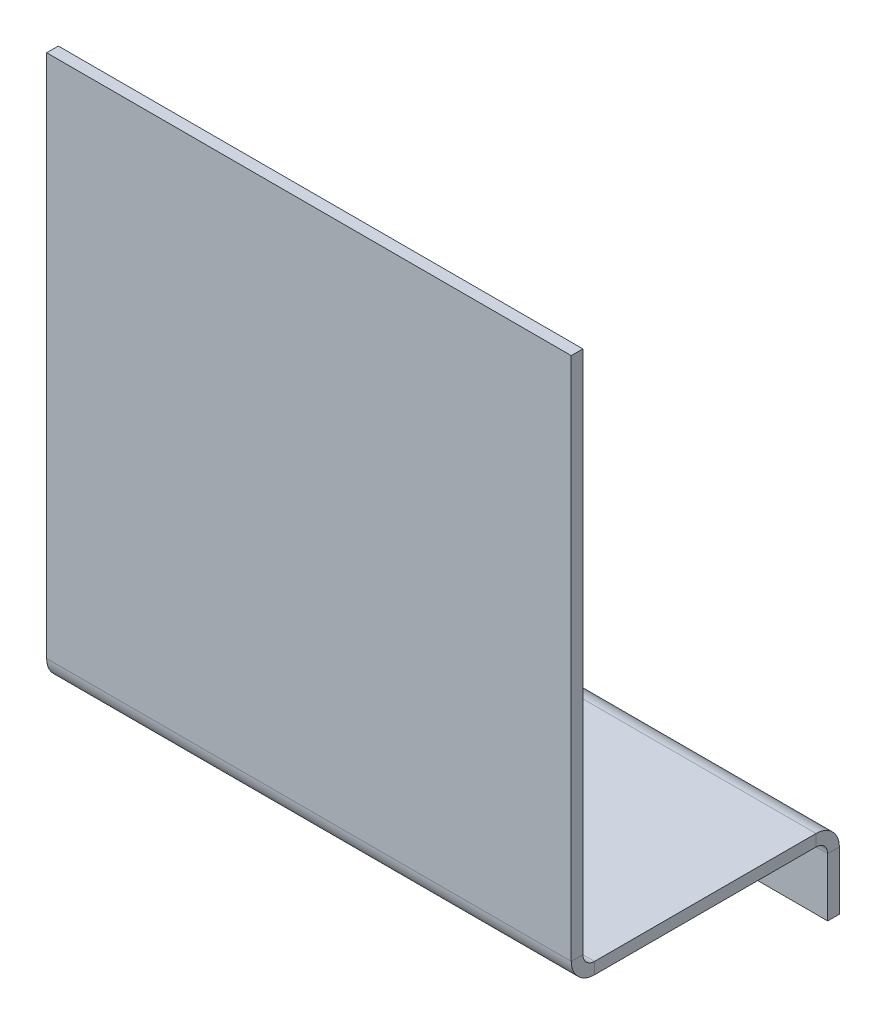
ISO-10303-21;
HEADER;
FILE_DESCRIPTION(('STEP AP214'),'2;1');
FILE_NAME('part.step','',(''),(''),'','','');
FILE_SCHEMA(('AUTOMOTIVE_DESIGN { 1 0 10303 214 1 1 1 1 }'));
ENDSEC;
DATA;
#1=APPLICATION_CONTEXT('core data for automotive mechanical design processes');
#2=APPLICATION_PROTOCOL_DEFINITION('international standard','automotive_design',2000,#1);
#3=PRODUCT_CONTEXT('',#1,'mechanical');
#4=PRODUCT('Part','Part','',(#3));
#5=PRODUCT_RELATED_PRODUCT_CATEGORY('part','',(#4));
#6=PRODUCT_DEFINITION_FORMATION('','',#4);
#7=PRODUCT_DEFINITION_CONTEXT('part definition',#1,'design');
#8=PRODUCT_DEFINITION('design','',#6,#7);
#9=PRODUCT_DEFINITION_SHAPE('','',#8);
#10=(LENGTH_UNIT() NAMED_UNIT(*) SI_UNIT(.MILLI.,.METRE.));
#11=(NAMED_UNIT(*) PLANE_ANGLE_UNIT() SI_UNIT($,.RADIAN.));
#12=(NAMED_UNIT(*) SI_UNIT($,.STERADIAN.) SOLID_ANGLE_UNIT());
#13=UNCERTAINTY_MEASURE_WITH_UNIT(LENGTH_MEASURE(1.E-05),#10,'distance_accuracy_value','');
#14=(GEOMETRIC_REPRESENTATION_CONTEXT(3) GLOBAL_UNCERTAINTY_ASSIGNED_CONTEXT((#13)) GLOBAL_UNIT_ASSIGNED_CONTEXT((#10,
#11,#12)) REPRESENTATION_CONTEXT('',''));
#15=CARTESIAN_POINT('',(0.,0.,0.));
#16=DIRECTION('',(0.,0.,1.));
#17=DIRECTION('',(1.,0.,0.));
#18=AXIS2_PLACEMENT_3D('',#15,#16,#17);
#19=CARTESIAN_POINT('',(45.,45.,0.));
#20=DIRECTION('',(0.,0.,-1.));
#21=DIRECTION('',(-1.,0.,0.));
#22=AXIS2_PLACEMENT_3D('',#19,#20,#21);
#23=PLANE('',#22);
#24=CARTESIAN_POINT('',(0.,0.,0.));
#25=DIRECTION('',(0.,0.,-1.));
#26=DIRECTION('',(-1.,0.,0.));
#27=AXIS2_PLACEMENT_3D('',#24,#25,#26);
#28=CIRCLE('',#27,15.);
#29=CARTESIAN_POINT('',(15.,0.,0.));
#30=VERTEX_POINT('',#29);
#31=CARTESIAN_POINT('',(0.,15.,0.));
#32=VERTEX_POINT('',#31);
#33=EDGE_CURVE('E365',#30,#32,#28,.F.);
#34=ORIENTED_EDGE('',*,*,#33,.T.);
#35=DIRECTION('',(0.,1.,0.));
#36=VECTOR('',#35,1.);
#37=CARTESIAN_POINT('',(0.,45.,0.));
#38=LINE('',#37,#36);
#39=CARTESIAN_POINT('',(0.,20.,0.));
#40=VERTEX_POINT('',#39);
#41=EDGE_CURVE('E13',#32,#40,#38,.T.);
#42=ORIENTED_EDGE('',*,*,#41,.T.);
#43=CARTESIAN_POINT('',(0.,0.,0.));
#44=DIRECTION('',(0.,0.,-1.));
#45=DIRECTION('',(-1.,0.,0.));
#46=AXIS2_PLACEMENT_3D('',#43,#44,#45);
#47=CIRCLE('',#46,20.);
#48=CARTESIAN_POINT('',(20.,0.,0.));
#49=VERTEX_POINT('',#48);
#50=EDGE_CURVE('E358',#49,#40,#47,.F.);
#51=ORIENTED_EDGE('',*,*,#50,.F.);
#52=DIRECTION('',(1.,0.,0.));
#53=VECTOR('',#52,1.);
#54=CARTESIAN_POINT('',(45.,0.,0.));
#55=LINE('',#54,#53);
#56=EDGE_CURVE('E377',#30,#49,#55,.T.);
#57=ORIENTED_EDGE('',*,*,#56,.F.);
#58=EDGE_LOOP('',(#34,#42,#51,#57));
#59=FACE_BOUND('',#58,.T.);
#60=ADVANCED_FACE('F76',(#59),#23,.T.);
#61=CARTESIAN_POINT('',(0.,0.,0.));
#62=DIRECTION('',(0.,0.,-1.));
#63=DIRECTION('',(-1.,0.,0.));
#64=AXIS2_PLACEMENT_3D('',#61,#62,#63);
#65=CIRCLE('',#64,10.);
#66=CARTESIAN_POINT('',(10.,0.,0.));
#67=VERTEX_POINT('',#66);
#68=CARTESIAN_POINT('',(0.,10.,0.));
#69=VERTEX_POINT('',#68);
#70=EDGE_CURVE('E372',#67,#69,#65,.F.);
#71=ORIENTED_EDGE('',*,*,#70,.T.);
#72=DIRECTION('',(0.,1.,0.));
#73=VECTOR('',#72,1.);
#74=CARTESIAN_POINT('',(0.,45.,0.));
#75=LINE('',#74,#73);
#76=EDGE_CURVE('E86',#69,#32,#75,.T.);
#77=ORIENTED_EDGE('',*,*,#76,.T.);
#78=ORIENTED_EDGE('',*,*,#33,.F.);
#79=DIRECTION('',(1.,0.,0.));
#80=VECTOR('',#79,1.);
#81=CARTESIAN_POINT('',(45.,0.,0.));
#82=LINE('',#81,#80);
#83=EDGE_CURVE('E389',#67,#30,#82,.T.);
#84=ORIENTED_EDGE('',*,*,#83,.F.);
#85=EDGE_LOOP('',(#71,#77,#78,#84));
#86=FACE_BOUND('',#85,.T.);
#87=ADVANCED_FACE('F487',(#86),#23,.T.);
#88=CARTESIAN_POINT('',(0.,0.,0.));
#89=DIRECTION('',(0.,0.,-1.));
#90=DIRECTION('',(-1.,0.,0.));
#91=AXIS2_PLACEMENT_3D('',#88,#89,#90);
#92=CIRCLE('',#91,5.);
#93=CARTESIAN_POINT('',(5.,0.,0.));
#94=VERTEX_POINT('',#93);
#95=CARTESIAN_POINT('',(0.,5.,0.));
#96=VERTEX_POINT('',#95);
#97=EDGE_CURVE('E379',#94,#96,#92,.F.);
#98=ORIENTED_EDGE('',*,*,#97,.T.);
#99=DIRECTION('',(0.,1.,0.));
#100=VECTOR('',#99,1.);
#101=CARTESIAN_POINT('',(0.,45.,0.));
#102=LINE('',#101,#100);
#103=EDGE_CURVE('E401',#96,#69,#102,.T.);
#104=ORIENTED_EDGE('',*,*,#103,.T.);
#105=ORIENTED_EDGE('',*,*,#70,.F.);
#106=DIRECTION('',(1.,0.,0.));
#107=VECTOR('',#106,1.);
#108=CARTESIAN_POINT('',(45.,0.,0.));
#109=LINE('',#108,#107);
#110=EDGE_CURVE('E388',#94,#67,#109,.T.);
#111=ORIENTED_EDGE('',*,*,#110,.F.);
#112=EDGE_LOOP('',(#98,#104,#105,#111));
#113=FACE_BOUND('',#112,.T.);
#114=ADVANCED_FACE('F491',(#113),#23,.T.);
#115=DIRECTION('',(1.,0.,0.));
#116=VECTOR('',#115,1.);
#117=CARTESIAN_POINT('',(45.,0.,0.));
#118=LINE('',#117,#116);
#119=CARTESIAN_POINT('',(0.,0.,0.));
#120=VERTEX_POINT('',#119);
#121=EDGE_CURVE('E394',#120,#94,#118,.T.);
#122=ORIENTED_EDGE('',*,*,#121,.F.);
#123=DIRECTION('',(0.,1.,0.));
#124=VECTOR('',#123,1.);
#125=CARTESIAN_POINT('',(0.,45.,0.));
#126=LINE('',#125,#124);
#127=EDGE_CURVE('E405',#120,#96,#126,.T.);
#128=ORIENTED_EDGE('',*,*,#127,.T.);
#129=ORIENTED_EDGE('',*,*,#97,.F.);
#130=EDGE_LOOP('',(#122,#128,#129));
#131=FACE_BOUND('',#130,.T.);
#132=ADVANCED_FACE('F547',(#131),#23,.T.);
#133=CARTESIAN_POINT('',(0.,-5.,0.));
#134=VERTEX_POINT('',#133);
#135=EDGE_CURVE('E378',#134,#94,#92,.F.);
#136=ORIENTED_EDGE('',*,*,#135,.F.);
#137=DIRECTION('',(0.,1.,0.));
#138=VECTOR('',#137,1.);
#139=CARTESIAN_POINT('',(0.,45.,0.));
#140=LINE('',#139,#138);
#141=EDGE_CURVE('E409',#134,#120,#140,.T.);
#142=ORIENTED_EDGE('',*,*,#141,.T.);
#143=ORIENTED_EDGE('',*,*,#121,.T.);
#144=EDGE_LOOP('',(#136,#142,#143));
#145=FACE_BOUND('',#144,.T.);
#146=ADVANCED_FACE('F458',(#145),#23,.T.);
#147=CARTESIAN_POINT('',(0.,-10.,0.));
#148=VERTEX_POINT('',#147);
#149=EDGE_CURVE('E371',#148,#67,#65,.F.);
#150=ORIENTED_EDGE('',*,*,#149,.F.);
#151=DIRECTION('',(0.,1.,0.));
#152=VECTOR('',#151,1.);
#153=CARTESIAN_POINT('',(0.,45.,0.));
#154=LINE('',#153,#152);
#155=EDGE_CURVE('E413',#148,#134,#154,.T.);
#156=ORIENTED_EDGE('',*,*,#155,.T.);
#157=ORIENTED_EDGE('',*,*,#135,.T.);
#158=ORIENTED_EDGE('',*,*,#110,.T.);
#159=EDGE_LOOP('',(#150,#156,#157,#158));
#160=FACE_BOUND('',#159,.T.);
#161=ADVANCED_FACE('F454',(#160),#23,.T.);
#162=CARTESIAN_POINT('',(0.,-15.,0.));
#163=VERTEX_POINT('',#162);
#164=EDGE_CURVE('E364',#163,#30,#28,.F.);
#165=ORIENTED_EDGE('',*,*,#164,.F.);
#166=DIRECTION('',(0.,1.,0.));
#167=VECTOR('',#166,1.);
#168=CARTESIAN_POINT('',(0.,45.,0.));
#169=LINE('',#168,#167);
#170=EDGE_CURVE('E416',#163,#148,#169,.T.);
#171=ORIENTED_EDGE('',*,*,#170,.T.);
#172=ORIENTED_EDGE('',*,*,#149,.T.);
#173=ORIENTED_EDGE('',*,*,#83,.T.);
#174=EDGE_LOOP('',(#165,#171,#172,#173));
#175=FACE_BOUND('',#174,.T.);
#176=ADVANCED_FACE('F435',(#175),#23,.T.);
#177=CARTESIAN_POINT('',(0.,-20.,0.));
#178=VERTEX_POINT('',#177);
#179=EDGE_CURVE('E357',#178,#49,#47,.F.);
#180=ORIENTED_EDGE('',*,*,#179,.F.);
#181=DIRECTION('',(0.,1.,0.));
#182=VECTOR('',#181,1.);
#183=CARTESIAN_POINT('',(0.,45.,0.));
#184=LINE('',#183,#182);
#185=EDGE_CURVE('E80',#178,#163,#184,.T.);
#186=ORIENTED_EDGE('',*,*,#185,.T.);
#187=ORIENTED_EDGE('',*,*,#164,.T.);
#188=ORIENTED_EDGE('',*,*,#56,.T.);
#189=EDGE_LOOP('',(#180,#186,#187,#188));
#190=FACE_BOUND('',#189,.T.);
#191=ADVANCED_FACE('F431',(#190),#23,.T.);
#192=ORIENTED_EDGE('',*,*,#141,.F.);
#193=CARTESIAN_POINT('',(-5.,0.,0.));
#194=VERTEX_POINT('',#193);
#195=EDGE_CURVE('E373',#194,#134,#92,.F.);
#196=ORIENTED_EDGE('',*,*,#195,.F.);
#197=EDGE_CURVE('E395',#194,#120,#118,.T.);
#198=ORIENTED_EDGE('',*,*,#197,.T.);
#199=EDGE_LOOP('',(#192,#196,#198));
#200=FACE_BOUND('',#199,.T.);
#201=ADVANCED_FACE('F479',(#200),#23,.T.);
#202=ORIENTED_EDGE('',*,*,#155,.F.);
#203=CARTESIAN_POINT('',(-10.,0.,0.));
#204=VERTEX_POINT('',#203);
#205=EDGE_CURVE('E366',#204,#148,#65,.F.);
#206=ORIENTED_EDGE('',*,*,#205,.F.);
#207=EDGE_CURVE('E390',#204,#194,#109,.T.);
#208=ORIENTED_EDGE('',*,*,#207,.T.);
#209=ORIENTED_EDGE('',*,*,#195,.T.);
#210=EDGE_LOOP('',(#202,#206,#208,#209));
#211=FACE_BOUND('',#210,.T.);
#212=ADVANCED_FACE('F448',(#211),#23,.T.);
#213=ORIENTED_EDGE('',*,*,#170,.F.);
#214=CARTESIAN_POINT('',(-15.,0.,0.));
#215=VERTEX_POINT('',#214);
#216=EDGE_CURVE('E359',#215,#163,#28,.F.);
#217=ORIENTED_EDGE('',*,*,#216,.F.);
#218=EDGE_CURVE('E384',#215,#204,#82,.T.);
#219=ORIENTED_EDGE('',*,*,#218,.T.);
#220=ORIENTED_EDGE('',*,*,#205,.T.);
#221=EDGE_LOOP('',(#213,#217,#219,#220));
#222=FACE_BOUND('',#221,.T.);
#223=ADVANCED_FACE('F444',(#222),#23,.T.);
#224=ORIENTED_EDGE('',*,*,#185,.F.);
#225=CARTESIAN_POINT('',(-20.,0.,0.));
#226=VERTEX_POINT('',#225);
#227=EDGE_CURVE('E352',#226,#178,#47,.F.);
#228=ORIENTED_EDGE('',*,*,#227,.F.);
#229=EDGE_CURVE('E383',#226,#215,#55,.T.);
#230=ORIENTED_EDGE('',*,*,#229,.T.);
#231=ORIENTED_EDGE('',*,*,#216,.T.);
#232=EDGE_LOOP('',(#224,#228,#230,#231));
#233=FACE_BOUND('',#232,.T.);
#234=ADVANCED_FACE('F441',(#233),#23,.T.);
#235=ORIENTED_EDGE('',*,*,#103,.F.);
#236=EDGE_CURVE('E370',#96,#194,#92,.F.);
#237=ORIENTED_EDGE('',*,*,#236,.T.);
#238=ORIENTED_EDGE('',*,*,#207,.F.);
#239=EDGE_CURVE('E363',#69,#204,#65,.F.);
#240=ORIENTED_EDGE('',*,*,#239,.F.);
#241=EDGE_LOOP('',(#235,#237,#238,#240));
#242=FACE_BOUND('',#241,.T.);
#243=ADVANCED_FACE('F474',(#242),#23,.T.);
#244=ORIENTED_EDGE('',*,*,#76,.F.);
#245=ORIENTED_EDGE('',*,*,#239,.T.);
#246=ORIENTED_EDGE('',*,*,#218,.F.);
#247=EDGE_CURVE('E356',#32,#215,#28,.F.);
#248=ORIENTED_EDGE('',*,*,#247,.F.);
#249=EDGE_LOOP('',(#244,#245,#246,#248));
#250=FACE_BOUND('',#249,.T.);
#251=ADVANCED_FACE('F509',(#250),#23,.T.);
#252=ORIENTED_EDGE('',*,*,#41,.F.);
#253=ORIENTED_EDGE('',*,*,#247,.T.);
#254=ORIENTED_EDGE('',*,*,#229,.F.);
#255=EDGE_CURVE('E351',#40,#226,#47,.F.);
#256=ORIENTED_EDGE('',*,*,#255,.F.);
#257=EDGE_LOOP('',(#252,#253,#254,#256));
#258=FACE_BOUND('',#257,.T.);
#259=ADVANCED_FACE('F504',(#258),#23,.T.);
#260=DIRECTION('',(0.,-1.,0.));
#261=VECTOR('',#260,1.);
#262=CARTESIAN_POINT('',(-45.,45.,0.));
#263=LINE('',#262,#261);
#264=CARTESIAN_POINT('',(-45.,45.,0.));
#265=VERTEX_POINT('',#264);
#266=CARTESIAN_POINT('',(-45.,-45.,0.));
#267=VERTEX_POINT('',#266);
#268=EDGE_CURVE('E325',#265,#267,#263,.T.);
#269=ORIENTED_EDGE('',*,*,#268,.F.);
#270=DIRECTION('',(-1.,0.,0.));
#271=VECTOR('',#270,1.);
#272=CARTESIAN_POINT('',(45.,45.,0.));
#273=LINE('',#272,#271);
#274=CARTESIAN_POINT('',(45.,45.,0.));
#275=VERTEX_POINT('',#274);
#276=EDGE_CURVE('E344',#275,#265,#273,.T.);
#277=ORIENTED_EDGE('',*,*,#276,.F.);
#278=DIRECTION('',(0.,-1.,0.));
#279=VECTOR('',#278,1.);
#280=CARTESIAN_POINT('',(45.,45.,0.));
#281=LINE('',#280,#279);
#282=CARTESIAN_POINT('',(45.,-45.,0.));
#283=VERTEX_POINT('',#282);
#284=EDGE_CURVE('E336',#275,#283,#281,.T.);
#285=ORIENTED_EDGE('',*,*,#284,.T.);
#286=DIRECTION('',(-1.,0.,0.));
#287=VECTOR('',#286,1.);
#288=CARTESIAN_POINT('',(45.,-45.,0.));
#289=LINE('',#288,#287);
#290=EDGE_CURVE('E346',#283,#267,#289,.T.);
#291=ORIENTED_EDGE('',*,*,#290,.T.);
#292=EDGE_LOOP('',(#269,#277,#285,#291));
#293=FACE_BOUND('',#292,.T.);
#294=ORIENTED_EDGE('',*,*,#227,.T.);
#295=ORIENTED_EDGE('',*,*,#179,.T.);
#296=ORIENTED_EDGE('',*,*,#50,.T.);
#297=ORIENTED_EDGE('',*,*,#255,.T.);
#298=EDGE_LOOP('',(#294,#295,#296,#297));
#299=FACE_BOUND('',#298,.T.);
#300=ADVANCED_FACE('F495',(#293,#299),#23,.T.);
#301=CARTESIAN_POINT('',(45.,45.,1.99999999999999));
#302=DIRECTION('',(0.,0.,-1.));
#303=DIRECTION('',(-1.,0.,0.));
#304=AXIS2_PLACEMENT_3D('',#301,#302,#303);
#305=PLANE('',#304);
#306=DIRECTION('',(0.,1.,0.));
#307=VECTOR('',#306,1.);
#308=CARTESIAN_POINT('',(-45.,45.,1.99999999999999));
#309=LINE('',#308,#307);
#310=CARTESIAN_POINT('',(-45.,45.,1.99999999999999));
#311=VERTEX_POINT('',#310);
#312=CARTESIAN_POINT('',(-45.,-45.,1.99999999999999));
#313=VERTEX_POINT('',#312);
#314=EDGE_CURVE('E318',#311,#313,#309,.F.);
#315=ORIENTED_EDGE('',*,*,#314,.T.);
#316=DIRECTION('',(-1.,0.,0.));
#317=VECTOR('',#316,1.);
#318=CARTESIAN_POINT('',(45.,-45.,1.99999999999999));
#319=LINE('',#318,#317);
#320=CARTESIAN_POINT('',(45.,-45.,1.99999999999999));
#321=VERTEX_POINT('',#320);
#322=EDGE_CURVE('E348',#321,#313,#319,.T.);
#323=ORIENTED_EDGE('',*,*,#322,.F.);
#324=DIRECTION('',(0.,1.,0.));
#325=VECTOR('',#324,1.);
#326=CARTESIAN_POINT('',(45.,45.,1.99999999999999));
#327=LINE('',#326,#325);
#328=CARTESIAN_POINT('',(45.,45.,1.99999999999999));
#329=VERTEX_POINT('',#328);
#330=EDGE_CURVE('E331',#329,#321,#327,.F.);
#331=ORIENTED_EDGE('',*,*,#330,.F.);
#332=DIRECTION('',(-1.,0.,0.));
#333=VECTOR('',#332,1.);
#334=CARTESIAN_POINT('',(45.,45.,1.99999999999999));
#335=LINE('',#334,#333);
#336=EDGE_CURVE('E342',#329,#311,#335,.T.);
#337=ORIENTED_EDGE('',*,*,#336,.T.);
#338=EDGE_LOOP('',(#315,#323,#331,#337));
#339=FACE_BOUND('',#338,.T.);
#340=ADVANCED_FACE('F78',(#339),#305,.F.);
#341=ORIENTED_EDGE('',*,*,#127,.F.);
#342=ORIENTED_EDGE('',*,*,#197,.F.);
#343=ORIENTED_EDGE('',*,*,#236,.F.);
#344=EDGE_LOOP('',(#341,#342,#343));
#345=FACE_BOUND('',#344,.T.);
#346=ADVANCED_FACE('F477',(#345),#23,.T.);
#347=CARTESIAN_POINT('',(45.,45.,1.99999999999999));
#348=DIRECTION('',(0.,1.,0.));
#349=DIRECTION('',(0.,0.,1.));
#350=AXIS2_PLACEMENT_3D('',#347,#348,#349);
#351=PLANE('',#350);
#352=DIRECTION('',(0.,0.,-1.));
#353=VECTOR('',#352,1.);
#354=CARTESIAN_POINT('',(-45.,45.,1.99999999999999));
#355=LINE('',#354,#353);
#356=EDGE_CURVE('E328',#311,#265,#355,.T.);
#357=ORIENTED_EDGE('',*,*,#356,.F.);
#358=ORIENTED_EDGE('',*,*,#336,.F.);
#359=DIRECTION('',(0.,0.,-1.));
#360=VECTOR('',#359,1.);
#361=CARTESIAN_POINT('',(45.,45.,1.99999999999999));
#362=LINE('',#361,#360);
#363=EDGE_CURVE('E339',#329,#275,#362,.T.);
#364=ORIENTED_EDGE('',*,*,#363,.T.);
#365=ORIENTED_EDGE('',*,*,#276,.T.);
#366=EDGE_LOOP('',(#357,#358,#364,#365));
#367=FACE_BOUND('',#366,.T.);
#368=ADVANCED_FACE('F494',(#367),#351,.T.);
#369=CARTESIAN_POINT('',(45.,-45.,1.99999999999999));
#370=DIRECTION('',(1.,0.,0.));
#371=DIRECTION('',(0.,0.,-1.));
#372=AXIS2_PLACEMENT_3D('',#369,#370,#371);
#373=PLANE('',#372);
#374=ORIENTED_EDGE('',*,*,#330,.T.);
#375=DIRECTION('',(0.,0.,1.));
#376=VECTOR('',#375,1.);
#377=CARTESIAN_POINT('',(45.,-45.,0.));
#378=LINE('',#377,#376);
#379=EDGE_CURVE('E333',#283,#321,#378,.T.);
#380=ORIENTED_EDGE('',*,*,#379,.F.);
#381=ORIENTED_EDGE('',*,*,#284,.F.);
#382=ORIENTED_EDGE('',*,*,#363,.F.);
#383=EDGE_LOOP('',(#374,#380,#381,#382));
#384=FACE_BOUND('',#383,.T.);
#385=ADVANCED_FACE('F500',(#384),#373,.T.);
#386=CARTESIAN_POINT('',(-45.,-45.,1.99999999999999));
#387=DIRECTION('',(1.,0.,0.));
#388=DIRECTION('',(0.,0.,-1.));
#389=AXIS2_PLACEMENT_3D('',#386,#387,#388);
#390=PLANE('',#389);
#391=ORIENTED_EDGE('',*,*,#314,.F.);
#392=ORIENTED_EDGE('',*,*,#356,.T.);
#393=ORIENTED_EDGE('',*,*,#268,.T.);
#394=DIRECTION('',(0.,0.,1.));
#395=VECTOR('',#394,1.);
#396=CARTESIAN_POINT('',(-45.,-45.,0.));
#397=LINE('',#396,#395);
#398=EDGE_CURVE('E323',#267,#313,#397,.T.);
#399=ORIENTED_EDGE('',*,*,#398,.T.);
#400=EDGE_LOOP('',(#391,#392,#393,#399));
#401=FACE_BOUND('',#400,.T.);
#402=ADVANCED_FACE('F770',(#401),#390,.F.);
#403=CARTESIAN_POINT('',(45.,-45.,-2.00000000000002));
#404=DIRECTION('',(1.,0.,0.));
#405=DIRECTION('',(0.,0.,-1.));
#406=AXIS2_PLACEMENT_3D('',#403,#404,#405);
#407=PLANE('',#406);
#408=DIRECTION('',(0.,1.,0.));
#409=VECTOR('',#408,1.);
#410=CARTESIAN_POINT('',(45.,-49.,-2.));
#411=LINE('',#410,#409);
#412=CARTESIAN_POINT('',(45.,-47.,-2.00000000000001));
#413=VERTEX_POINT('',#412);
#414=CARTESIAN_POINT('',(45.,-49.,-2.));
#415=VERTEX_POINT('',#414);
#416=EDGE_CURVE('E277',#413,#415,#411,.F.);
#417=ORIENTED_EDGE('',*,*,#416,.F.);
#418=CARTESIAN_POINT('',(45.,-45.,-2.00000000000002));
#419=DIRECTION('',(-1.,0.,0.));
#420=DIRECTION('',(0.,0.,1.));
#421=AXIS2_PLACEMENT_3D('',#418,#419,#420);
#422=CIRCLE('',#421,2.);
#423=EDGE_CURVE('E309',#283,#413,#422,.F.);
#424=ORIENTED_EDGE('',*,*,#423,.F.);
#425=ORIENTED_EDGE('',*,*,#379,.T.);
#426=CARTESIAN_POINT('',(45.,-45.,-2.00000000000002));
#427=DIRECTION('',(-1.,0.,0.));
#428=DIRECTION('',(0.,0.,1.));
#429=AXIS2_PLACEMENT_3D('',#426,#427,#428);
#430=CIRCLE('',#429,4.);
#431=EDGE_CURVE('E315',#321,#415,#430,.F.);
#432=ORIENTED_EDGE('',*,*,#431,.T.);
#433=EDGE_LOOP('',(#417,#424,#425,#432));
#434=FACE_BOUND('',#433,.T.);
#435=ADVANCED_FACE('F751',(#434),#407,.T.);
#436=CARTESIAN_POINT('',(-45.,-45.,-2.00000000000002));
#437=DIRECTION('',(1.,0.,0.));
#438=DIRECTION('',(0.,0.,-1.));
#439=AXIS2_PLACEMENT_3D('',#436,#437,#438);
#440=PLANE('',#439);
#441=CARTESIAN_POINT('',(-45.,-45.,-2.00000000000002));
#442=DIRECTION('',(-1.,0.,0.));
#443=DIRECTION('',(0.,0.,1.));
#444=AXIS2_PLACEMENT_3D('',#441,#442,#443);
#445=CIRCLE('',#444,2.);
#446=CARTESIAN_POINT('',(-45.,-47.,-2.00000000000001));
#447=VERTEX_POINT('',#446);
#448=EDGE_CURVE('E281',#447,#267,#445,.T.);
#449=ORIENTED_EDGE('',*,*,#448,.F.);
#450=DIRECTION('',(0.,1.,0.));
#451=VECTOR('',#450,1.);
#452=CARTESIAN_POINT('',(-45.,-47.,-2.00000000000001));
#453=LINE('',#452,#451);
#454=CARTESIAN_POINT('',(-45.,-49.,-2.));
#455=VERTEX_POINT('',#454);
#456=EDGE_CURVE('E302',#447,#455,#453,.F.);
#457=ORIENTED_EDGE('',*,*,#456,.T.);
#458=CARTESIAN_POINT('',(-45.,-45.,-2.00000000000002));
#459=DIRECTION('',(-1.,0.,0.));
#460=DIRECTION('',(0.,0.,1.));
#461=AXIS2_PLACEMENT_3D('',#458,#459,#460);
#462=CIRCLE('',#461,4.);
#463=EDGE_CURVE('E312',#455,#313,#462,.T.);
#464=ORIENTED_EDGE('',*,*,#463,.T.);
#465=ORIENTED_EDGE('',*,*,#398,.F.);
#466=EDGE_LOOP('',(#449,#457,#464,#465));
#467=FACE_BOUND('',#466,.T.);
#468=ADVANCED_FACE('F740',(#467),#440,.F.);
#469=CARTESIAN_POINT('',(-45.,-45.,-2.00000000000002));
#470=DIRECTION('',(-1.,0.,0.));
#471=DIRECTION('',(0.,-1.,0.));
#472=AXIS2_PLACEMENT_3D('',#469,#470,#471);
#473=CYLINDRICAL_SURFACE('',#472,4.);
#474=ORIENTED_EDGE('',*,*,#322,.T.);
#475=ORIENTED_EDGE('',*,*,#463,.F.);
#476=DIRECTION('',(-1.,0.,0.));
#477=VECTOR('',#476,1.);
#478=CARTESIAN_POINT('',(45.,-49.,-2.));
#479=LINE('',#478,#477);
#480=EDGE_CURVE('E300',#455,#415,#479,.F.);
#481=ORIENTED_EDGE('',*,*,#480,.T.);
#482=ORIENTED_EDGE('',*,*,#431,.F.);
#483=EDGE_LOOP('',(#474,#475,#481,#482));
#484=FACE_BOUND('',#483,.T.);
#485=ADVANCED_FACE('F737',(#484),#473,.T.);
#486=CARTESIAN_POINT('',(-45.,-45.,-2.00000000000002));
#487=DIRECTION('',(-1.,0.,0.));
#488=DIRECTION('',(0.,-1.,0.));
#489=AXIS2_PLACEMENT_3D('',#486,#487,#488);
#490=CYLINDRICAL_SURFACE('',#489,2.);
#491=ORIENTED_EDGE('',*,*,#290,.F.);
#492=ORIENTED_EDGE('',*,*,#423,.T.);
#493=DIRECTION('',(-1.,0.,0.));
#494=VECTOR('',#493,1.);
#495=CARTESIAN_POINT('',(45.,-47.,-2.00000000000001));
#496=LINE('',#495,#494);
#497=EDGE_CURVE('E305',#413,#447,#496,.T.);
#498=ORIENTED_EDGE('',*,*,#497,.T.);
#499=ORIENTED_EDGE('',*,*,#448,.T.);
#500=EDGE_LOOP('',(#491,#492,#498,#499));
#501=FACE_BOUND('',#500,.T.);
#502=ADVANCED_FACE('F719',(#501),#490,.F.);
#503=CARTESIAN_POINT('',(45.,-49.,0.));
#504=DIRECTION('',(-1.,0.,0.));
#505=DIRECTION('',(0.,0.,1.));
#506=AXIS2_PLACEMENT_3D('',#503,#504,#505);
#507=PLANE('',#506);
#508=ORIENTED_EDGE('',*,*,#416,.T.);
#509=DIRECTION('',(0.,0.,1.));
#510=VECTOR('',#509,1.);
#511=CARTESIAN_POINT('',(45.,-49.0000000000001,-40.));
#512=LINE('',#511,#510);
#513=CARTESIAN_POINT('',(45.,-49.0000000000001,-40.));
#514=VERTEX_POINT('',#513);
#515=EDGE_CURVE('E289',#514,#415,#512,.T.);
#516=ORIENTED_EDGE('',*,*,#515,.F.);
#517=DIRECTION('',(0.,1.,0.));
#518=VECTOR('',#517,1.);
#519=CARTESIAN_POINT('',(45.,-49.0000000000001,-40.));
#520=LINE('',#519,#518);
#521=CARTESIAN_POINT('',(45.,-47.0000000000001,-40.));
#522=VERTEX_POINT('',#521);
#523=EDGE_CURVE('E282',#514,#522,#520,.T.);
#524=ORIENTED_EDGE('',*,*,#523,.T.);
#525=DIRECTION('',(0.,0.,-1.));
#526=VECTOR('',#525,1.);
#527=CARTESIAN_POINT('',(45.,-47.,0.));
#528=LINE('',#527,#526);
#529=EDGE_CURVE('E297',#522,#413,#528,.F.);
#530=ORIENTED_EDGE('',*,*,#529,.T.);
#531=EDGE_LOOP('',(#508,#516,#524,#530));
#532=FACE_BOUND('',#531,.T.);
#533=ADVANCED_FACE('F708',(#532),#507,.F.);
#534=CARTESIAN_POINT('',(-45.,-49.0000000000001,-40.));
#535=DIRECTION('',(1.,0.,0.));
#536=DIRECTION('',(0.,0.,-1.));
#537=AXIS2_PLACEMENT_3D('',#534,#535,#536);
#538=PLANE('',#537);
#539=ORIENTED_EDGE('',*,*,#456,.F.);
#540=DIRECTION('',(0.,0.,1.));
#541=VECTOR('',#540,1.);
#542=CARTESIAN_POINT('',(-45.,-47.0000000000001,-40.));
#543=LINE('',#542,#541);
#544=CARTESIAN_POINT('',(-45.,-47.0000000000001,-40.));
#545=VERTEX_POINT('',#544);
#546=EDGE_CURVE('E295',#447,#545,#543,.F.);
#547=ORIENTED_EDGE('',*,*,#546,.T.);
#548=DIRECTION('',(0.,1.,0.));
#549=VECTOR('',#548,1.);
#550=CARTESIAN_POINT('',(-45.,-49.0000000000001,-40.));
#551=LINE('',#550,#549);
#552=CARTESIAN_POINT('',(-45.,-49.0000000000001,-40.));
#553=VERTEX_POINT('',#552);
#554=EDGE_CURVE('E278',#553,#545,#551,.T.);
#555=ORIENTED_EDGE('',*,*,#554,.F.);
#556=DIRECTION('',(0.,0.,-1.));
#557=VECTOR('',#556,1.);
#558=CARTESIAN_POINT('',(-45.,-49.0000000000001,-40.));
#559=LINE('',#558,#557);
#560=EDGE_CURVE('E287',#455,#553,#559,.T.);
#561=ORIENTED_EDGE('',*,*,#560,.F.);
#562=EDGE_LOOP('',(#539,#547,#555,#561));
#563=FACE_BOUND('',#562,.T.);
#564=ADVANCED_FACE('F697',(#563),#538,.F.);
#565=CARTESIAN_POINT('',(45.,-49.0000000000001,-40.));
#566=DIRECTION('',(0.,1.,0.));
#567=DIRECTION('',(0.,0.,1.));
#568=AXIS2_PLACEMENT_3D('',#565,#566,#567);
#569=PLANE('',#568);
#570=CARTESIAN_POINT('',(0.,-49.,-12.));
#571=DIRECTION('',(0.,1.,0.));
#572=DIRECTION('',(0.,0.,1.));
#573=AXIS2_PLACEMENT_3D('',#570,#571,#572);
#574=CIRCLE('',#573,3.19999999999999);
#575=CARTESIAN_POINT('',(0.,-49.,-8.80000000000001));
#576=VERTEX_POINT('',#575);
#577=EDGE_CURVE('E274',#576,#576,#574,.T.);
#578=ORIENTED_EDGE('',*,*,#577,.T.);
#579=EDGE_LOOP('',(#578));
#580=FACE_BOUND('',#579,.T.);
#581=ORIENTED_EDGE('',*,*,#480,.F.);
#582=ORIENTED_EDGE('',*,*,#560,.T.);
#583=DIRECTION('',(1.,0.,0.));
#584=VECTOR('',#583,1.);
#585=CARTESIAN_POINT('',(45.,-49.0000000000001,-40.));
#586=LINE('',#585,#584);
#587=EDGE_CURVE('E285',#553,#514,#586,.T.);
#588=ORIENTED_EDGE('',*,*,#587,.T.);
#589=ORIENTED_EDGE('',*,*,#515,.T.);
#590=EDGE_LOOP('',(#581,#582,#588,#589));
#591=FACE_BOUND('',#590,.T.);
#592=ADVANCED_FACE('F686',(#580,#591),#569,.F.);
#593=CARTESIAN_POINT('',(45.,-47.0000000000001,-40.));
#594=DIRECTION('',(0.,1.,0.));
#595=DIRECTION('',(0.,0.,1.));
#596=AXIS2_PLACEMENT_3D('',#593,#594,#595);
#597=PLANE('',#596);
#598=CARTESIAN_POINT('',(0.,-47.,-12.));
#599=DIRECTION('',(0.,1.,0.));
#600=DIRECTION('',(0.,0.,1.));
#601=AXIS2_PLACEMENT_3D('',#598,#599,#600);
#602=CIRCLE('',#601,3.19999999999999);
#603=CARTESIAN_POINT('',(0.,-47.,-8.80000000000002));
#604=VERTEX_POINT('',#603);
#605=EDGE_CURVE('E269',#604,#604,#602,.T.);
#606=ORIENTED_EDGE('',*,*,#605,.F.);
#607=EDGE_LOOP('',(#606));
#608=FACE_BOUND('',#607,.T.);
#609=ORIENTED_EDGE('',*,*,#546,.F.);
#610=ORIENTED_EDGE('',*,*,#497,.F.);
#611=ORIENTED_EDGE('',*,*,#529,.F.);
#612=DIRECTION('',(-1.,0.,0.));
#613=VECTOR('',#612,1.);
#614=CARTESIAN_POINT('',(45.,-47.0000000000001,-40.));
#615=LINE('',#614,#613);
#616=EDGE_CURVE('E292',#545,#522,#615,.F.);
#617=ORIENTED_EDGE('',*,*,#616,.F.);
#618=EDGE_LOOP('',(#609,#610,#611,#617));
#619=FACE_BOUND('',#618,.T.);
#620=ADVANCED_FACE('F681',(#608,#619),#597,.T.);
#621=CARTESIAN_POINT('',(0.,-47.,-12.));
#622=DIRECTION('',(0.,1.,0.));
#623=DIRECTION('',(0.,0.,1.));
#624=AXIS2_PLACEMENT_3D('',#621,#622,#623);
#625=CYLINDRICAL_SURFACE('',#624,3.19999999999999);
#626=ORIENTED_EDGE('',*,*,#577,.F.);
#627=EDGE_LOOP('',(#626));
#628=FACE_BOUND('',#627,.T.);
#629=ORIENTED_EDGE('',*,*,#605,.T.);
#630=EDGE_LOOP('',(#629));
#631=FACE_BOUND('',#630,.T.);
#632=ADVANCED_FACE('F672',(#628,#631),#625,.F.);
#633=CARTESIAN_POINT('',(-45.,-51.0000000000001,-40.));
#634=DIRECTION('',(-1.,0.,0.));
#635=DIRECTION('',(0.,0.,1.));
#636=AXIS2_PLACEMENT_3D('',#633,#634,#635);
#637=PLANE('',#636);
#638=DIRECTION('',(0.,0.,1.));
#639=VECTOR('',#638,1.);
#640=CARTESIAN_POINT('',(-45.,-51.0000000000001,-44.));
#641=LINE('',#640,#639);
#642=CARTESIAN_POINT('',(-45.,-51.0000000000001,-42.));
#643=VERTEX_POINT('',#642);
#644=CARTESIAN_POINT('',(-45.,-51.0000000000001,-44.));
#645=VERTEX_POINT('',#644);
#646=EDGE_CURVE('E240',#643,#645,#641,.F.);
#647=ORIENTED_EDGE('',*,*,#646,.F.);
#648=CARTESIAN_POINT('',(-45.,-51.0000000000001,-40.));
#649=DIRECTION('',(1.,0.,0.));
#650=DIRECTION('',(0.,0.,-1.));
#651=AXIS2_PLACEMENT_3D('',#648,#649,#650);
#652=CIRCLE('',#651,2.);
#653=EDGE_CURVE('E259',#553,#643,#652,.F.);
#654=ORIENTED_EDGE('',*,*,#653,.F.);
#655=ORIENTED_EDGE('',*,*,#554,.T.);
#656=CARTESIAN_POINT('',(-45.,-51.0000000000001,-40.));
#657=DIRECTION('',(1.,0.,0.));
#658=DIRECTION('',(0.,0.,-1.));
#659=AXIS2_PLACEMENT_3D('',#656,#657,#658);
#660=CIRCLE('',#659,4.);
#661=EDGE_CURVE('E266',#545,#645,#660,.F.);
#662=ORIENTED_EDGE('',*,*,#661,.T.);
#663=EDGE_LOOP('',(#647,#654,#655,#662));
#664=FACE_BOUND('',#663,.T.);
#665=ADVANCED_FACE('F653',(#664),#637,.T.);
#666=CARTESIAN_POINT('',(45.,-51.0000000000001,-40.));
#667=DIRECTION('',(-1.,0.,0.));
#668=DIRECTION('',(0.,0.,1.));
#669=AXIS2_PLACEMENT_3D('',#666,#667,#668);
#670=PLANE('',#669);
#671=CARTESIAN_POINT('',(45.,-51.0000000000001,-40.));
#672=DIRECTION('',(1.,0.,0.));
#673=DIRECTION('',(0.,0.,-1.));
#674=AXIS2_PLACEMENT_3D('',#671,#672,#673);
#675=CIRCLE('',#674,2.);
#676=CARTESIAN_POINT('',(45.,-51.0000000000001,-42.));
#677=VERTEX_POINT('',#676);
#678=EDGE_CURVE('E263',#677,#514,#675,.T.);
#679=ORIENTED_EDGE('',*,*,#678,.F.);
#680=DIRECTION('',(0.,0.,1.));
#681=VECTOR('',#680,1.);
#682=CARTESIAN_POINT('',(45.,-51.0000000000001,-42.));
#683=LINE('',#682,#681);
#684=CARTESIAN_POINT('',(45.,-51.0000000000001,-44.));
#685=VERTEX_POINT('',#684);
#686=EDGE_CURVE('E252',#677,#685,#683,.F.);
#687=ORIENTED_EDGE('',*,*,#686,.T.);
#688=CARTESIAN_POINT('',(45.,-51.0000000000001,-40.));
#689=DIRECTION('',(1.,0.,0.));
#690=DIRECTION('',(0.,0.,-1.));
#691=AXIS2_PLACEMENT_3D('',#688,#689,#690);
#692=CIRCLE('',#691,4.);
#693=EDGE_CURVE('E262',#685,#522,#692,.T.);
#694=ORIENTED_EDGE('',*,*,#693,.T.);
#695=ORIENTED_EDGE('',*,*,#523,.F.);
#696=EDGE_LOOP('',(#679,#687,#694,#695));
#697=FACE_BOUND('',#696,.T.);
#698=ADVANCED_FACE('F642',(#697),#670,.F.);
#699=CARTESIAN_POINT('',(45.,-51.0000000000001,-40.));
#700=DIRECTION('',(1.,0.,0.));
#701=DIRECTION('',(0.,0.,-1.));
#702=AXIS2_PLACEMENT_3D('',#699,#700,#701);
#703=CYLINDRICAL_SURFACE('',#702,4.);
#704=ORIENTED_EDGE('',*,*,#616,.T.);
#705=ORIENTED_EDGE('',*,*,#693,.F.);
#706=DIRECTION('',(1.,0.,0.));
#707=VECTOR('',#706,1.);
#708=CARTESIAN_POINT('',(-45.,-51.0000000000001,-44.));
#709=LINE('',#708,#707);
#710=EDGE_CURVE('E250',#685,#645,#709,.F.);
#711=ORIENTED_EDGE('',*,*,#710,.T.);
#712=ORIENTED_EDGE('',*,*,#661,.F.);
#713=EDGE_LOOP('',(#704,#705,#711,#712));
#714=FACE_BOUND('',#713,.T.);
#715=ADVANCED_FACE('F639',(#714),#703,.T.);
#716=CARTESIAN_POINT('',(45.,-51.0000000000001,-40.));
#717=DIRECTION('',(1.,0.,0.));
#718=DIRECTION('',(0.,0.,-1.));
#719=AXIS2_PLACEMENT_3D('',#716,#717,#718);
#720=CYLINDRICAL_SURFACE('',#719,2.);
#721=ORIENTED_EDGE('',*,*,#587,.F.);
#722=ORIENTED_EDGE('',*,*,#653,.T.);
#723=DIRECTION('',(1.,0.,0.));
#724=VECTOR('',#723,1.);
#725=CARTESIAN_POINT('',(-45.,-51.0000000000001,-42.));
#726=LINE('',#725,#724);
#727=EDGE_CURVE('E255',#643,#677,#726,.T.);
#728=ORIENTED_EDGE('',*,*,#727,.T.);
#729=ORIENTED_EDGE('',*,*,#678,.T.);
#730=EDGE_LOOP('',(#721,#722,#728,#729));
#731=FACE_BOUND('',#730,.T.);
#732=ADVANCED_FACE('F628',(#731),#720,.F.);
#733=CARTESIAN_POINT('',(45.,-61.0000000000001,-44.));
#734=DIRECTION('',(-1.,0.,0.));
#735=DIRECTION('',(0.,0.,1.));
#736=AXIS2_PLACEMENT_3D('',#733,#734,#735);
#737=PLANE('',#736);
#738=ORIENTED_EDGE('',*,*,#686,.F.);
#739=DIRECTION('',(0.,1.,0.));
#740=VECTOR('',#739,1.);
#741=CARTESIAN_POINT('',(45.,-61.0000000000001,-42.));
#742=LINE('',#741,#740);
#743=CARTESIAN_POINT('',(45.,-61.0000000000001,-42.));
#744=VERTEX_POINT('',#743);
#745=EDGE_CURVE('E248',#677,#744,#742,.F.);
#746=ORIENTED_EDGE('',*,*,#745,.T.);
#747=DIRECTION('',(0.,0.,1.));
#748=VECTOR('',#747,1.);
#749=CARTESIAN_POINT('',(45.,-61.0000000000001,-44.));
#750=LINE('',#749,#748);
#751=CARTESIAN_POINT('',(45.,-61.0000000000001,-44.));
#752=VERTEX_POINT('',#751);
#753=EDGE_CURVE('E236',#752,#744,#750,.T.);
#754=ORIENTED_EDGE('',*,*,#753,.F.);
#755=DIRECTION('',(0.,-1.,0.));
#756=VECTOR('',#755,1.);
#757=CARTESIAN_POINT('',(45.,-49.0000000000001,-44.));
#758=LINE('',#757,#756);
#759=EDGE_CURVE('E223',#685,#752,#758,.T.);
#760=ORIENTED_EDGE('',*,*,#759,.F.);
#761=EDGE_LOOP('',(#738,#746,#754,#760));
#762=FACE_BOUND('',#761,.T.);
#763=ADVANCED_FACE('F618',(#762),#737,.F.);
#764=CARTESIAN_POINT('',(-45.,-49.0000000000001,-44.));
#765=DIRECTION('',(1.,0.,0.));
#766=DIRECTION('',(0.,0.,-1.));
#767=AXIS2_PLACEMENT_3D('',#764,#765,#766);
#768=PLANE('',#767);
#769=ORIENTED_EDGE('',*,*,#646,.T.);
#770=DIRECTION('',(0.,1.,0.));
#771=VECTOR('',#770,1.);
#772=CARTESIAN_POINT('',(-45.,-49.0000000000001,-44.));
#773=LINE('',#772,#771);
#774=CARTESIAN_POINT('',(-45.,-61.0000000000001,-44.));
#775=VERTEX_POINT('',#774);
#776=EDGE_CURVE('E221',#775,#645,#773,.T.);
#777=ORIENTED_EDGE('',*,*,#776,.F.);
#778=DIRECTION('',(0.,0.,1.));
#779=VECTOR('',#778,1.);
#780=CARTESIAN_POINT('',(-45.,-61.0000000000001,-44.));
#781=LINE('',#780,#779);
#782=CARTESIAN_POINT('',(-45.,-61.0000000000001,-42.));
#783=VERTEX_POINT('',#782);
#784=EDGE_CURVE('E229',#775,#783,#781,.T.);
#785=ORIENTED_EDGE('',*,*,#784,.T.);
#786=DIRECTION('',(0.,-1.,0.));
#787=VECTOR('',#786,1.);
#788=CARTESIAN_POINT('',(-45.,-49.0000000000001,-42.));
#789=LINE('',#788,#787);
#790=EDGE_CURVE('E245',#783,#643,#789,.F.);
#791=ORIENTED_EDGE('',*,*,#790,.T.);
#792=EDGE_LOOP('',(#769,#777,#785,#791));
#793=FACE_BOUND('',#792,.T.);
#794=ADVANCED_FACE('F239',(#793),#768,.F.);
#795=CARTESIAN_POINT('',(45.,-49.0000000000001,-44.));
#796=DIRECTION('',(0.,0.,1.));
#797=DIRECTION('',(1.,0.,0.));
#798=AXIS2_PLACEMENT_3D('',#795,#796,#797);
#799=PLANE('',#798);
#800=CARTESIAN_POINT('',(0.,-56.0000000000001,-44.0000000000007));
#801=DIRECTION('',(0.,0.,-1.));
#802=DIRECTION('',(-1.,0.,0.));
#803=AXIS2_PLACEMENT_3D('',#800,#801,#802);
#804=CIRCLE('',#803,2.14999999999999);
#805=CARTESIAN_POINT('',(-2.14999999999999,-56.0000000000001,-44.0000000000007));
#806=VERTEX_POINT('',#805);
#807=EDGE_CURVE('E1021',#806,#806,#804,.T.);
#808=ORIENTED_EDGE('',*,*,#807,.F.);
#809=EDGE_LOOP('',(#808));
#810=FACE_BOUND('',#809,.T.);
#811=ORIENTED_EDGE('',*,*,#710,.F.);
#812=ORIENTED_EDGE('',*,*,#759,.T.);
#813=DIRECTION('',(-1.,0.,0.));
#814=VECTOR('',#813,1.);
#815=CARTESIAN_POINT('',(45.,-61.0000000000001,-44.));
#816=LINE('',#815,#814);
#817=EDGE_CURVE('E216',#752,#775,#816,.T.);
#818=ORIENTED_EDGE('',*,*,#817,.T.);
#819=ORIENTED_EDGE('',*,*,#776,.T.);
#820=EDGE_LOOP('',(#811,#812,#818,#819));
#821=FACE_BOUND('',#820,.T.);
#822=ADVANCED_FACE('F219',(#810,#821),#799,.F.);
#823=CARTESIAN_POINT('',(45.,-49.0000000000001,-42.));
#824=DIRECTION('',(0.,0.,1.));
#825=DIRECTION('',(1.,0.,0.));
#826=AXIS2_PLACEMENT_3D('',#823,#824,#825);
#827=PLANE('',#826);
#828=CARTESIAN_POINT('',(0.,-56.0000000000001,-42.));
#829=DIRECTION('',(0.,0.,1.));
#830=DIRECTION('',(1.,0.,0.));
#831=AXIS2_PLACEMENT_3D('',#828,#829,#830);
#832=CIRCLE('',#831,2.14999999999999);
#833=CARTESIAN_POINT('',(2.14999999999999,-56.0000000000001,-42.));
#834=VERTEX_POINT('',#833);
#835=EDGE_CURVE('E258',#834,#834,#832,.T.);
#836=ORIENTED_EDGE('',*,*,#835,.F.);
#837=EDGE_LOOP('',(#836));
#838=FACE_BOUND('',#837,.T.);
#839=ORIENTED_EDGE('',*,*,#745,.F.);
#840=ORIENTED_EDGE('',*,*,#727,.F.);
#841=ORIENTED_EDGE('',*,*,#790,.F.);
#842=DIRECTION('',(1.,0.,0.));
#843=VECTOR('',#842,1.);
#844=CARTESIAN_POINT('',(-45.,-61.0000000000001,-42.));
#845=LINE('',#844,#843);
#846=EDGE_CURVE('E232',#744,#783,#845,.F.);
#847=ORIENTED_EDGE('',*,*,#846,.F.);
#848=EDGE_LOOP('',(#839,#840,#841,#847));
#849=FACE_BOUND('',#848,.T.);
#850=ADVANCED_FACE('F586',(#838,#849),#827,.T.);
#851=CARTESIAN_POINT('',(-45.,-61.0000000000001,-44.));
#852=DIRECTION('',(0.,1.,0.));
#853=DIRECTION('',(0.,0.,1.));
#854=AXIS2_PLACEMENT_3D('',#851,#852,#853);
#855=PLANE('',#854);
#856=ORIENTED_EDGE('',*,*,#846,.T.);
#857=ORIENTED_EDGE('',*,*,#784,.F.);
#858=ORIENTED_EDGE('',*,*,#817,.F.);
#859=ORIENTED_EDGE('',*,*,#753,.T.);
#860=EDGE_LOOP('',(#856,#857,#858,#859));
#861=FACE_BOUND('',#860,.T.);
#862=ADVANCED_FACE('F230',(#861),#855,.F.);
#863=CARTESIAN_POINT('',(0.,-56.0000000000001,-44.0000000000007));
#864=DIRECTION('',(0.,0.,-1.));
#865=DIRECTION('',(-1.,0.,0.));
#866=AXIS2_PLACEMENT_3D('',#863,#864,#865);
#867=CYLINDRICAL_SURFACE('',#866,2.14999999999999);
#868=ORIENTED_EDGE('',*,*,#807,.T.);
#869=EDGE_LOOP('',(#868));
#870=FACE_BOUND('',#869,.T.);
#871=ORIENTED_EDGE('',*,*,#835,.T.);
#872=EDGE_LOOP('',(#871));
#873=FACE_BOUND('',#872,.T.);
#874=ADVANCED_FACE('F573',(#870,#873),#867,.F.);
#875=CLOSED_SHELL('',(#60,#87,#114,#132,#146,#161,#176,#191,#201,#212,#223,#234,#243,#251,#259,
#300,#340,#346,#368,#385,#402,#435,#468,#485,#502,#533,#564,#592,#620,#632,#665,#698,#715,#732,
#763,#794,#822,#850,#862,#874));
#876=MANIFOLD_SOLID_BREP('B2',#875);
#877=ADVANCED_BREP_SHAPE_REPRESENTATION('',(#18,#876),#14);
#878=SHAPE_DEFINITION_REPRESENTATION(#9,#877);
ENDSEC;
END-ISO-10303-21;
